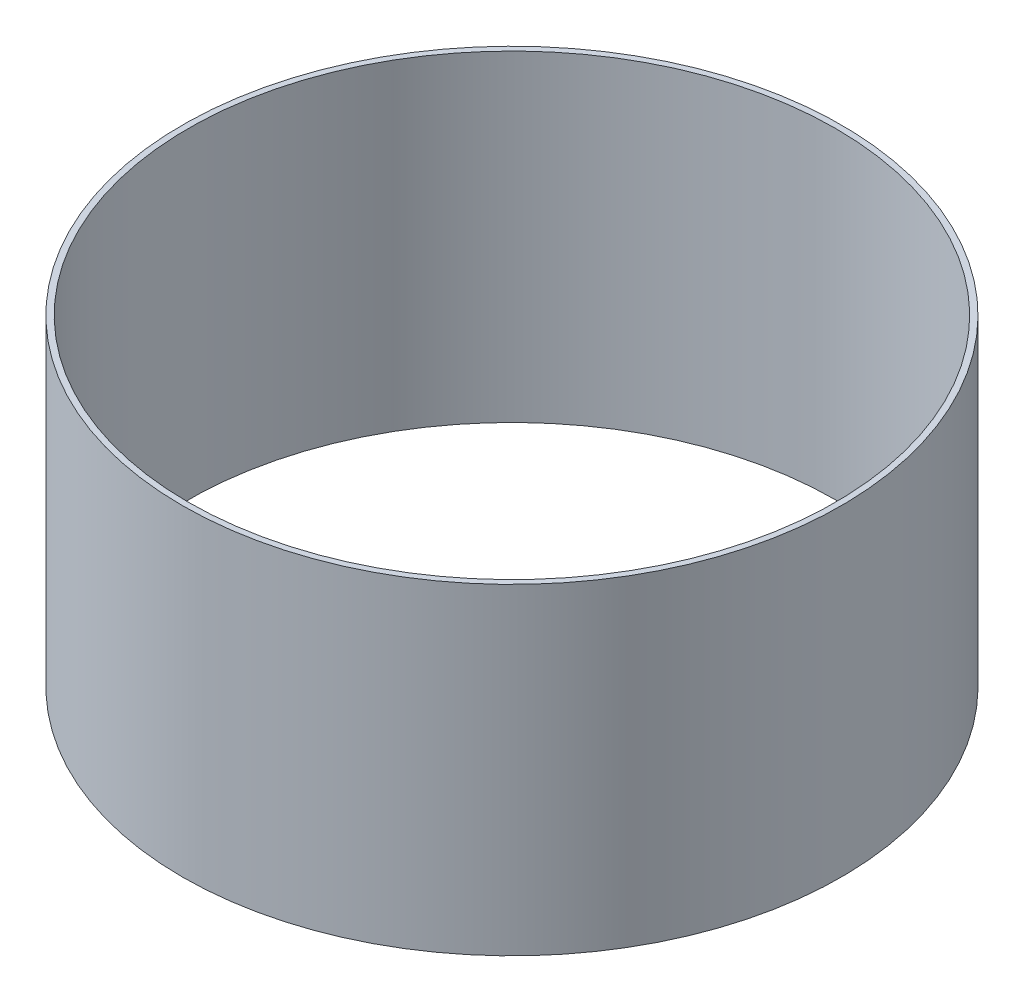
from build123d import *

# Parameters (mm, degrees)
ESQUISSE11_R                              = 711
ESQUISSE11_R_2                            = 698.3
TUBES_RONDS_ASME_B_36_10_M_1996_142_DEPTH = 694


with BuildPart() as part:
    # Esquisse11 → Tubes ronds - asme - b 36.10 m_1996 _142 (new body)
    with BuildSketch(Plane(origin=(0, 12, 0), x_dir=(-1, 0, 0), z_dir=(0, 1, 0))):
        Circle(ESQUISSE11_R)
        Circle(ESQUISSE11_R_2, mode=Mode.SUBTRACT)
    extrude(amount=TUBES_RONDS_ASME_B_36_10_M_1996_142_DEPTH)


solid = part.part
